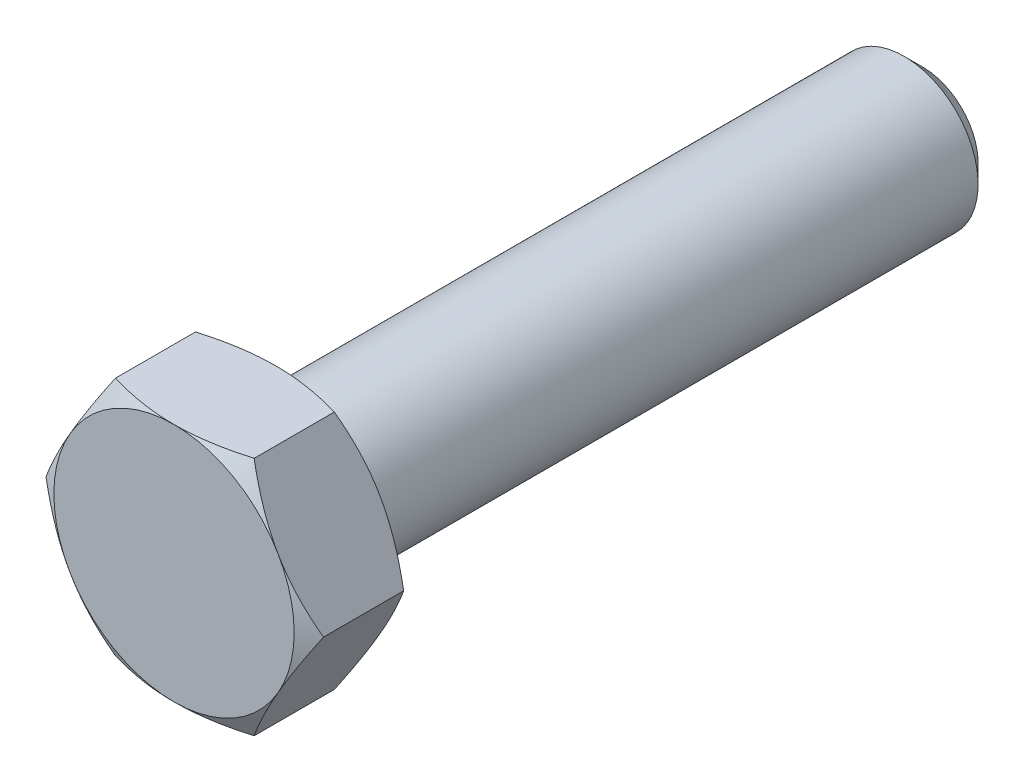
from build123d import *

# Parameters (mm, degrees)
BASE_EXTRUSION_DEPTH    = 5.5
ESQUISSE2_R             = 8.952008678
ESQUISSE2_R_2           = 6.5
ENL_V_MAT_EXTRU_1_DEPTH = 5
ENL_V_MAT_EXTRU_1_DRAFT = -60
ESQUISSE3_R             = 9.119331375
ESQUISSE3_R_2           = 6.5
ENL_V_MAT_EXTRU_2_DEPTH = 5
ENL_V_MAT_EXTRU_2_DRAFT = -60
ESQUISSE4_R             = 4
BOSS_EXTRU_1_DEPTH      = 35
CHANFREIN1_SIZE         = 1


with BuildPart() as part:
    # Esquisse1 → Base-Extrusion (new body)
    with BuildSketch(Plane.XY):
        Polygon((-3.75277675, -6.5), (-7.505553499, 0), (-3.75277675, 6.5), (3.75277675, 6.5), (7.505553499, 0), (3.75277675, -6.5), align=None)
    extrude(amount=BASE_EXTRUSION_DEPTH)


with BuildPart() as enl_v_mat_extru_1_tool:
    # Esquisse2 → Enl_v. mat.-Extru.1 (with draft: the straight prism first)
    with BuildSketch(Plane(origin=(0, 0, 0), x_dir=(-1, 0, 0), z_dir=(0, 0, -1))):
        Circle(ESQUISSE2_R)
        Circle(ESQUISSE2_R_2, mode=Mode.SUBTRACT)
    extrude(amount=-ENL_V_MAT_EXTRU_1_DEPTH)
    # Enl_v. mat.-Extru.1: the draft: its side faces are tilted about the plane it starts from
    enl_v_mat_extru_1_sides = [enl_v_mat_extru_1_tool.faces().sort_by_distance(p)[0] for p in [
        (8.952008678, 0, 2.5),
        (6.5, 0, 2.5),
    ]]
    draft(enl_v_mat_extru_1_sides, Plane(origin=(0, 0, 0), x_dir=(-1, 0, 0), z_dir=(0, 0, -1)), ENL_V_MAT_EXTRU_1_DRAFT)


with BuildPart() as part_1:
    add(part.part)

    # Enl_v. mat.-Extru.1: cut by enl_v_mat_extru_1_tool
    add(enl_v_mat_extru_1_tool.part, mode=Mode.SUBTRACT)


with BuildPart() as enl_v_mat_extru_2_tool:
    # Esquisse3 → Enl_v. mat.-Extru.2 (with draft: the straight prism first)
    with BuildSketch(Plane.XY.offset(5.5)):
        Circle(ESQUISSE3_R)
        Circle(ESQUISSE3_R_2, mode=Mode.SUBTRACT)
    extrude(amount=-ENL_V_MAT_EXTRU_2_DEPTH)
    # Enl_v. mat.-Extru.2: the draft: its side faces are tilted about the plane it starts from
    enl_v_mat_extru_2_sides = [enl_v_mat_extru_2_tool.faces().sort_by_distance(p)[0] for p in [
        (-9.119331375, 0, 3),
        (-6.5, 0, 3),
    ]]
    draft(enl_v_mat_extru_2_sides, Plane.XY.offset(5.5), ENL_V_MAT_EXTRU_2_DRAFT)


with BuildPart() as part_2:
    add(part_1.part)

    # Enl_v. mat.-Extru.2: cut by enl_v_mat_extru_2_tool
    add(enl_v_mat_extru_2_tool.part, mode=Mode.SUBTRACT)

    # Esquisse4 → Boss.-Extru.1 (add)
    with BuildSketch(Plane(origin=(0, 0, 0), x_dir=(-1, 0, 0), z_dir=(0, 0, -1))):
        Circle(ESQUISSE4_R)
    extrude(amount=BOSS_EXTRU_1_DEPTH)

    # Chanfrein1
    chanfrein1_edges = [part_2.edges().sort_by_distance(p)[0] for p in [
        (4, 0, -35),
    ]]
    chamfer(chanfrein1_edges, length=CHANFREIN1_SIZE)


solid = part_2.part
